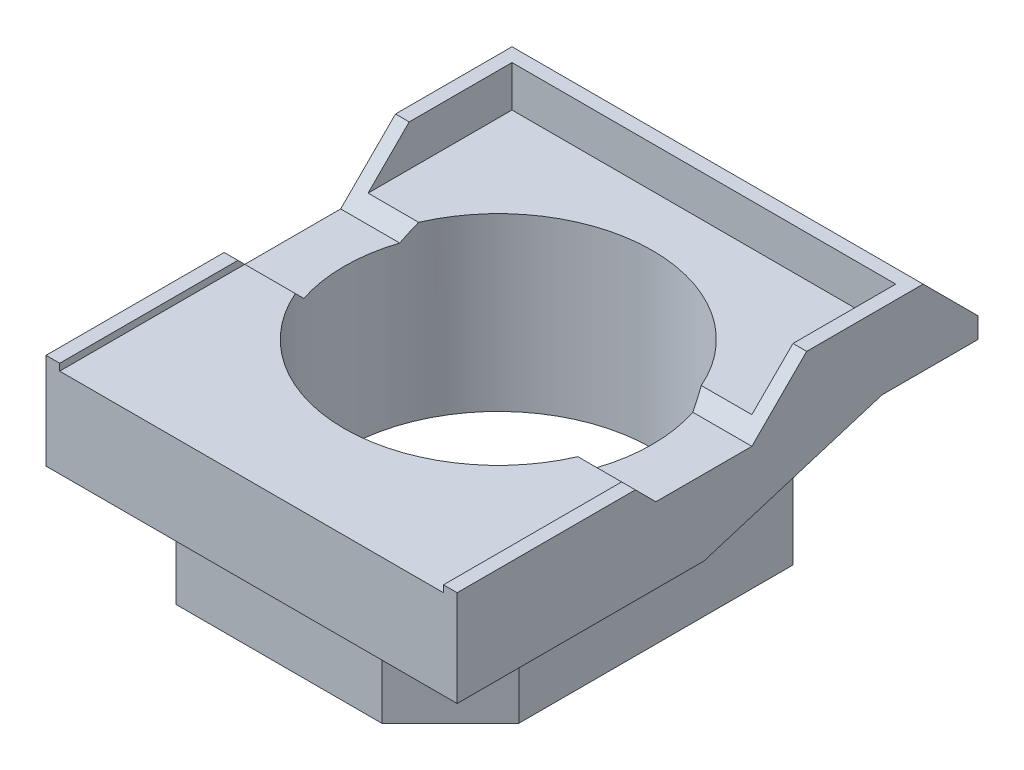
ISO-10303-21;
HEADER;
FILE_DESCRIPTION(('STEP AP214'),'2;1');
FILE_NAME('part.step','',(''),(''),'','','');
FILE_SCHEMA(('AUTOMOTIVE_DESIGN { 1 0 10303 214 1 1 1 1 }'));
ENDSEC;
DATA;
#1=APPLICATION_CONTEXT('core data for automotive mechanical design processes');
#2=APPLICATION_PROTOCOL_DEFINITION('international standard','automotive_design',2000,#1);
#3=PRODUCT_CONTEXT('',#1,'mechanical');
#4=PRODUCT('Part','Part','',(#3));
#5=PRODUCT_RELATED_PRODUCT_CATEGORY('part','',(#4));
#6=PRODUCT_DEFINITION_FORMATION('','',#4);
#7=PRODUCT_DEFINITION_CONTEXT('part definition',#1,'design');
#8=PRODUCT_DEFINITION('design','',#6,#7);
#9=PRODUCT_DEFINITION_SHAPE('','',#8);
#10=(LENGTH_UNIT() NAMED_UNIT(*) SI_UNIT(.MILLI.,.METRE.));
#11=(NAMED_UNIT(*) PLANE_ANGLE_UNIT() SI_UNIT($,.RADIAN.));
#12=(NAMED_UNIT(*) SI_UNIT($,.STERADIAN.) SOLID_ANGLE_UNIT());
#13=UNCERTAINTY_MEASURE_WITH_UNIT(LENGTH_MEASURE(1.E-05),#10,'distance_accuracy_value','');
#14=(GEOMETRIC_REPRESENTATION_CONTEXT(3) GLOBAL_UNCERTAINTY_ASSIGNED_CONTEXT((#13)) GLOBAL_UNIT_ASSIGNED_CONTEXT((#10,
#11,#12)) REPRESENTATION_CONTEXT('',''));
#15=CARTESIAN_POINT('',(0.,0.,0.));
#16=DIRECTION('',(0.,0.,1.));
#17=DIRECTION('',(1.,0.,0.));
#18=AXIS2_PLACEMENT_3D('',#15,#16,#17);
#19=CARTESIAN_POINT('',(15.,9.5,-7.49999999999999));
#20=DIRECTION('',(0.,-0.707106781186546,-0.707106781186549));
#21=DIRECTION('',(0.,0.707106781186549,-0.707106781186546));
#22=AXIS2_PLACEMENT_3D('',#19,#20,#21);
#23=PLANE('',#22);
#24=DIRECTION('',(-1.,0.,0.));
#25=VECTOR('',#24,1.);
#26=CARTESIAN_POINT('',(15.,5.5,-3.5));
#27=LINE('',#26,#25);
#28=CARTESIAN_POINT('',(-10.6917023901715,5.5,-3.5));
#29=VERTEX_POINT('',#28);
#30=CARTESIAN_POINT('',(-15.,5.5,-3.5));
#31=VERTEX_POINT('',#30);
#32=EDGE_CURVE('E267',#29,#31,#27,.T.);
#33=ORIENTED_EDGE('',*,*,#32,.F.);
#34=CARTESIAN_POINT('',(0.,1.99999999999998,0.));
#35=DIRECTION('',(0.,-0.707106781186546,-0.707106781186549));
#36=DIRECTION('',(0.,-0.707106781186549,0.707106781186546));
#37=AXIS2_PLACEMENT_3D('',#34,#35,#36);
#38=ELLIPSE('',#37,15.9099025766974,11.25);
#39=CARTESIAN_POINT('',(-10.3107953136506,6.5,-4.5));
#40=VERTEX_POINT('',#39);
#41=EDGE_CURVE('E251',#29,#40,#38,.T.);
#42=ORIENTED_EDGE('',*,*,#41,.T.);
#43=DIRECTION('',(-1.,0.,0.));
#44=VECTOR('',#43,1.);
#45=CARTESIAN_POINT('',(15.,6.5,-4.5));
#46=LINE('',#45,#44);
#47=CARTESIAN_POINT('',(-14.,6.5,-4.5));
#48=VERTEX_POINT('',#47);
#49=EDGE_CURVE('E264',#40,#48,#46,.T.);
#50=ORIENTED_EDGE('',*,*,#49,.T.);
#51=DIRECTION('',(0.,0.707106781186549,-0.707106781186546));
#52=VECTOR('',#51,1.);
#53=CARTESIAN_POINT('',(-14.,9.5,-7.49999999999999));
#54=LINE('',#53,#52);
#55=CARTESIAN_POINT('',(-14.,9.5,-7.49999999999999));
#56=VERTEX_POINT('',#55);
#57=EDGE_CURVE('E293',#48,#56,#54,.T.);
#58=ORIENTED_EDGE('',*,*,#57,.T.);
#59=DIRECTION('',(-1.,0.,0.));
#60=VECTOR('',#59,1.);
#61=CARTESIAN_POINT('',(15.,9.5,-7.49999999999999));
#62=LINE('',#61,#60);
#63=CARTESIAN_POINT('',(-15.,9.5,-7.49999999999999));
#64=VERTEX_POINT('',#63);
#65=EDGE_CURVE('E435',#56,#64,#62,.T.);
#66=ORIENTED_EDGE('',*,*,#65,.T.);
#67=DIRECTION('',(0.,-0.707106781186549,0.707106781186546));
#68=VECTOR('',#67,1.);
#69=CARTESIAN_POINT('',(-15.,9.5,-7.49999999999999));
#70=LINE('',#69,#68);
#71=EDGE_CURVE('E398',#64,#31,#70,.T.);
#72=ORIENTED_EDGE('',*,*,#71,.T.);
#73=EDGE_LOOP('',(#33,#42,#50,#58,#66,#72));
#74=FACE_BOUND('',#73,.T.);
#75=ADVANCED_FACE('F28',(#74),#23,.F.);
#76=CARTESIAN_POINT('',(15.,5.5,-3.5));
#77=DIRECTION('',(0.,-1.,0.));
#78=DIRECTION('',(0.,0.,-1.));
#79=AXIS2_PLACEMENT_3D('',#76,#77,#78);
#80=PLANE('',#79);
#81=CARTESIAN_POINT('',(15.,5.5,-3.5));
#82=VERTEX_POINT('',#81);
#83=CARTESIAN_POINT('',(10.6917023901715,5.5,-3.5));
#84=VERTEX_POINT('',#83);
#85=EDGE_CURVE('E432',#82,#84,#27,.T.);
#86=ORIENTED_EDGE('',*,*,#85,.T.);
#87=CARTESIAN_POINT('',(0.,5.5,0.));
#88=DIRECTION('',(0.,-1.,0.));
#89=DIRECTION('',(0.,0.,-1.));
#90=AXIS2_PLACEMENT_3D('',#87,#88,#89);
#91=CIRCLE('',#90,11.25);
#92=CARTESIAN_POINT('',(10.6917023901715,5.5,3.5));
#93=VERTEX_POINT('',#92);
#94=EDGE_CURVE('E603',#84,#93,#91,.T.);
#95=ORIENTED_EDGE('',*,*,#94,.T.);
#96=DIRECTION('',(-1.,0.,0.));
#97=VECTOR('',#96,1.);
#98=CARTESIAN_POINT('',(15.,5.5,3.5));
#99=LINE('',#98,#97);
#100=CARTESIAN_POINT('',(15.,5.5,3.5));
#101=VERTEX_POINT('',#100);
#102=EDGE_CURVE('E429',#101,#93,#99,.T.);
#103=ORIENTED_EDGE('',*,*,#102,.F.);
#104=DIRECTION('',(0.,0.,1.));
#105=VECTOR('',#104,1.);
#106=CARTESIAN_POINT('',(15.,5.5,-3.5));
#107=LINE('',#106,#105);
#108=EDGE_CURVE('E420',#82,#101,#107,.T.);
#109=ORIENTED_EDGE('',*,*,#108,.F.);
#110=EDGE_LOOP('',(#86,#95,#103,#109));
#111=FACE_BOUND('',#110,.T.);
#112=ADVANCED_FACE('F565',(#111),#80,.F.);
#113=CARTESIAN_POINT('',(15.,5.5,3.5));
#114=DIRECTION('',(0.,-0.707106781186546,0.707106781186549));
#115=DIRECTION('',(0.,-0.707106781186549,-0.707106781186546));
#116=AXIS2_PLACEMENT_3D('',#113,#114,#115);
#117=PLANE('',#116);
#118=ORIENTED_EDGE('',*,*,#102,.T.);
#119=CARTESIAN_POINT('',(0.,1.99999999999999,0.));
#120=DIRECTION('',(0.,-0.707106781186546,0.707106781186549));
#121=DIRECTION('',(0.,-0.707106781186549,-0.707106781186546));
#122=AXIS2_PLACEMENT_3D('',#119,#120,#121);
#123=ELLIPSE('',#122,15.9099025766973,11.25);
#124=CARTESIAN_POINT('',(10.3107953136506,6.5,4.49999999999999));
#125=VERTEX_POINT('',#124);
#126=EDGE_CURVE('E599',#93,#125,#123,.T.);
#127=ORIENTED_EDGE('',*,*,#126,.T.);
#128=DIRECTION('',(1.,0.,0.));
#129=VECTOR('',#128,1.);
#130=CARTESIAN_POINT('',(15.,6.5,4.49999999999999));
#131=LINE('',#130,#129);
#132=CARTESIAN_POINT('',(14.,6.5,4.49999999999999));
#133=VERTEX_POINT('',#132);
#134=EDGE_CURVE('E449',#125,#133,#131,.T.);
#135=ORIENTED_EDGE('',*,*,#134,.T.);
#136=DIRECTION('',(0.,0.707106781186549,0.707106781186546));
#137=VECTOR('',#136,1.);
#138=CARTESIAN_POINT('',(14.,5.5,3.5));
#139=LINE('',#138,#137);
#140=CARTESIAN_POINT('',(14.,7.,4.99999999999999));
#141=VERTEX_POINT('',#140);
#142=EDGE_CURVE('E453',#133,#141,#139,.T.);
#143=ORIENTED_EDGE('',*,*,#142,.T.);
#144=DIRECTION('',(-1.,0.,0.));
#145=VECTOR('',#144,1.);
#146=CARTESIAN_POINT('',(15.,7.,4.99999999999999));
#147=LINE('',#146,#145);
#148=CARTESIAN_POINT('',(15.,7.,4.99999999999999));
#149=VERTEX_POINT('',#148);
#150=EDGE_CURVE('E425',#149,#141,#147,.T.);
#151=ORIENTED_EDGE('',*,*,#150,.F.);
#152=DIRECTION('',(0.,0.707106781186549,0.707106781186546));
#153=VECTOR('',#152,1.);
#154=CARTESIAN_POINT('',(15.,5.5,3.5));
#155=LINE('',#154,#153);
#156=EDGE_CURVE('E422',#101,#149,#155,.T.);
#157=ORIENTED_EDGE('',*,*,#156,.F.);
#158=EDGE_LOOP('',(#118,#127,#135,#143,#151,#157));
#159=FACE_BOUND('',#158,.T.);
#160=ADVANCED_FACE('F569',(#159),#117,.F.);
#161=CARTESIAN_POINT('',(15.,7.,4.99999999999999));
#162=DIRECTION('',(0.,-1.,0.));
#163=DIRECTION('',(0.,0.,-1.));
#164=AXIS2_PLACEMENT_3D('',#161,#162,#163);
#165=PLANE('',#164);
#166=DIRECTION('',(-1.,0.,0.));
#167=VECTOR('',#166,1.);
#168=CARTESIAN_POINT('',(15.,7.,18.));
#169=LINE('',#168,#167);
#170=CARTESIAN_POINT('',(-14.,7.,18.));
#171=VERTEX_POINT('',#170);
#172=CARTESIAN_POINT('',(-15.,7.,18.));
#173=VERTEX_POINT('',#172);
#174=EDGE_CURVE('E445',#171,#173,#169,.T.);
#175=ORIENTED_EDGE('',*,*,#174,.F.);
#176=DIRECTION('',(0.,0.,-1.));
#177=VECTOR('',#176,1.);
#178=CARTESIAN_POINT('',(-14.,7.,5.));
#179=LINE('',#178,#177);
#180=CARTESIAN_POINT('',(-14.,7.,4.99999999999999));
#181=VERTEX_POINT('',#180);
#182=EDGE_CURVE('E290',#171,#181,#179,.T.);
#183=ORIENTED_EDGE('',*,*,#182,.T.);
#184=CARTESIAN_POINT('',(-15.,7.,4.99999999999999));
#185=VERTEX_POINT('',#184);
#186=EDGE_CURVE('E424',#181,#185,#147,.T.);
#187=ORIENTED_EDGE('',*,*,#186,.T.);
#188=DIRECTION('',(0.,0.,1.));
#189=VECTOR('',#188,1.);
#190=CARTESIAN_POINT('',(-15.,7.,4.99999999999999));
#191=LINE('',#190,#189);
#192=EDGE_CURVE('E385',#185,#173,#191,.T.);
#193=ORIENTED_EDGE('',*,*,#192,.T.);
#194=EDGE_LOOP('',(#175,#183,#187,#193));
#195=FACE_BOUND('',#194,.T.);
#196=ADVANCED_FACE('F639',(#195),#165,.F.);
#197=CARTESIAN_POINT('',(15.,2.00000000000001,-20.));
#198=DIRECTION('',(0.,0.,1.));
#199=DIRECTION('',(1.,0.,0.));
#200=AXIS2_PLACEMENT_3D('',#197,#198,#199);
#201=PLANE('',#200);
#202=DIRECTION('',(1.,0.,0.));
#203=VECTOR('',#202,1.);
#204=CARTESIAN_POINT('',(12.5,4.,-20.));
#205=LINE('',#204,#203);
#206=CARTESIAN_POINT('',(-15.,4.,-20.));
#207=VERTEX_POINT('',#206);
#208=CARTESIAN_POINT('',(15.,4.,-20.));
#209=VERTEX_POINT('',#208);
#210=EDGE_CURVE('E338',#207,#209,#205,.T.);
#211=ORIENTED_EDGE('',*,*,#210,.F.);
#212=DIRECTION('',(0.,1.,0.));
#213=VECTOR('',#212,1.);
#214=CARTESIAN_POINT('',(-15.,2.00000000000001,-20.));
#215=LINE('',#214,#213);
#216=CARTESIAN_POINT('',(-15.,5.50000000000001,-20.));
#217=VERTEX_POINT('',#216);
#218=EDGE_CURVE('E391',#207,#217,#215,.T.);
#219=ORIENTED_EDGE('',*,*,#218,.T.);
#220=DIRECTION('',(-1.,0.,0.));
#221=VECTOR('',#220,1.);
#222=CARTESIAN_POINT('',(15.,5.50000000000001,-20.));
#223=LINE('',#222,#221);
#224=CARTESIAN_POINT('',(15.,5.50000000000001,-20.));
#225=VERTEX_POINT('',#224);
#226=EDGE_CURVE('E442',#225,#217,#223,.T.);
#227=ORIENTED_EDGE('',*,*,#226,.F.);
#228=DIRECTION('',(0.,1.,0.));
#229=VECTOR('',#228,1.);
#230=CARTESIAN_POINT('',(15.,2.00000000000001,-20.));
#231=LINE('',#230,#229);
#232=EDGE_CURVE('E412',#209,#225,#231,.T.);
#233=ORIENTED_EDGE('',*,*,#232,.F.);
#234=EDGE_LOOP('',(#211,#219,#227,#233));
#235=FACE_BOUND('',#234,.T.);
#236=ADVANCED_FACE('F543',(#235),#201,.F.);
#237=CARTESIAN_POINT('',(-15.,7.,18.));
#238=DIRECTION('',(1.,0.,0.));
#239=DIRECTION('',(0.,0.,-1.));
#240=AXIS2_PLACEMENT_3D('',#237,#238,#239);
#241=PLANE('',#240);
#242=DIRECTION('',(0.,0.,1.));
#243=VECTOR('',#242,1.);
#244=CARTESIAN_POINT('',(-15.,4.,-13.));
#245=LINE('',#244,#243);
#246=CARTESIAN_POINT('',(-15.,4.,-13.));
#247=VERTEX_POINT('',#246);
#248=EDGE_CURVE('E318',#207,#247,#245,.T.);
#249=ORIENTED_EDGE('',*,*,#248,.T.);
#250=DIRECTION('',(0.,-0.294085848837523,0.95577900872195));
#251=VECTOR('',#250,1.);
#252=CARTESIAN_POINT('',(-15.,0.,0.));
#253=LINE('',#252,#251);
#254=CARTESIAN_POINT('',(-15.,0.,0.));
#255=VERTEX_POINT('',#254);
#256=EDGE_CURVE('E315',#247,#255,#253,.T.);
#257=ORIENTED_EDGE('',*,*,#256,.T.);
#258=DIRECTION('',(0.,0.,-1.));
#259=VECTOR('',#258,1.);
#260=CARTESIAN_POINT('',(-15.,0.,18.));
#261=LINE('',#260,#259);
#262=CARTESIAN_POINT('',(-15.,0.,18.));
#263=VERTEX_POINT('',#262);
#264=EDGE_CURVE('E382',#263,#255,#261,.T.);
#265=ORIENTED_EDGE('',*,*,#264,.F.);
#266=DIRECTION('',(0.,-1.,0.));
#267=VECTOR('',#266,1.);
#268=CARTESIAN_POINT('',(-15.,7.,18.));
#269=LINE('',#268,#267);
#270=EDGE_CURVE('E388',#173,#263,#269,.T.);
#271=ORIENTED_EDGE('',*,*,#270,.F.);
#272=ORIENTED_EDGE('',*,*,#192,.F.);
#273=DIRECTION('',(0.,0.707106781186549,0.707106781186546));
#274=VECTOR('',#273,1.);
#275=CARTESIAN_POINT('',(-15.,5.5,3.5));
#276=LINE('',#275,#274);
#277=CARTESIAN_POINT('',(-15.,5.5,3.5));
#278=VERTEX_POINT('',#277);
#279=EDGE_CURVE('E403',#278,#185,#276,.T.);
#280=ORIENTED_EDGE('',*,*,#279,.F.);
#281=DIRECTION('',(0.,0.,1.));
#282=VECTOR('',#281,1.);
#283=CARTESIAN_POINT('',(-15.,5.5,-3.5));
#284=LINE('',#283,#282);
#285=EDGE_CURVE('E400',#31,#278,#284,.T.);
#286=ORIENTED_EDGE('',*,*,#285,.F.);
#287=ORIENTED_EDGE('',*,*,#71,.F.);
#288=DIRECTION('',(0.,0.,1.));
#289=VECTOR('',#288,1.);
#290=CARTESIAN_POINT('',(-15.,9.5,-16.));
#291=LINE('',#290,#289);
#292=CARTESIAN_POINT('',(-15.,9.5,-16.));
#293=VERTEX_POINT('',#292);
#294=EDGE_CURVE('E395',#293,#64,#291,.T.);
#295=ORIENTED_EDGE('',*,*,#294,.F.);
#296=DIRECTION('',(0.,0.707106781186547,0.707106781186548));
#297=VECTOR('',#296,1.);
#298=CARTESIAN_POINT('',(-15.,5.50000000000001,-20.));
#299=LINE('',#298,#297);
#300=EDGE_CURVE('E393',#217,#293,#299,.T.);
#301=ORIENTED_EDGE('',*,*,#300,.F.);
#302=ORIENTED_EDGE('',*,*,#218,.F.);
#303=EDGE_LOOP('',(#249,#257,#265,#271,#272,#280,#286,#287,#295,#301,#302));
#304=FACE_BOUND('',#303,.T.);
#305=ADVANCED_FACE('F528',(#304),#241,.F.);
#306=CARTESIAN_POINT('',(15.,0.,18.));
#307=DIRECTION('',(0.,1.,0.));
#308=DIRECTION('',(0.,0.,1.));
#309=AXIS2_PLACEMENT_3D('',#306,#307,#308);
#310=PLANE('',#309);
#311=DIRECTION('',(-1.,0.,0.));
#312=VECTOR('',#311,1.);
#313=CARTESIAN_POINT('',(-12.5,0.,0.));
#314=LINE('',#313,#312);
#315=CARTESIAN_POINT('',(-12.5,0.,0.));
#316=VERTEX_POINT('',#315);
#317=EDGE_CURVE('E325',#316,#255,#314,.T.);
#318=ORIENTED_EDGE('',*,*,#317,.F.);
#319=DIRECTION('',(0.,0.,-1.));
#320=VECTOR('',#319,1.);
#321=CARTESIAN_POINT('',(-12.5,0.,16.));
#322=LINE('',#321,#320);
#323=CARTESIAN_POINT('',(-12.5,0.,11.));
#324=VERTEX_POINT('',#323);
#325=EDGE_CURVE('E366',#324,#316,#322,.T.);
#326=ORIENTED_EDGE('',*,*,#325,.F.);
#327=DIRECTION('',(-0.707106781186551,0.,-0.707106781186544));
#328=VECTOR('',#327,1.);
#329=CARTESIAN_POINT('',(4.75000000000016,0.,28.2499999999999));
#330=LINE('',#329,#328);
#331=CARTESIAN_POINT('',(-7.49999999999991,0.,16.));
#332=VERTEX_POINT('',#331);
#333=EDGE_CURVE('E11',#324,#332,#330,.F.);
#334=ORIENTED_EDGE('',*,*,#333,.T.);
#335=DIRECTION('',(-1.,0.,0.));
#336=VECTOR('',#335,1.);
#337=CARTESIAN_POINT('',(12.5,0.,16.));
#338=LINE('',#337,#336);
#339=CARTESIAN_POINT('',(7.49999999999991,0.,16.));
#340=VERTEX_POINT('',#339);
#341=EDGE_CURVE('E364',#340,#332,#338,.T.);
#342=ORIENTED_EDGE('',*,*,#341,.F.);
#343=DIRECTION('',(-0.707106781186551,0.,0.707106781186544));
#344=VECTOR('',#343,1.);
#345=CARTESIAN_POINT('',(10.25,0.,13.2499999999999));
#346=LINE('',#345,#344);
#347=CARTESIAN_POINT('',(12.5,0.,11.));
#348=VERTEX_POINT('',#347);
#349=EDGE_CURVE('E36',#340,#348,#346,.F.);
#350=ORIENTED_EDGE('',*,*,#349,.T.);
#351=DIRECTION('',(0.,0.,1.));
#352=VECTOR('',#351,1.);
#353=CARTESIAN_POINT('',(12.5,0.,-9.));
#354=LINE('',#353,#352);
#355=CARTESIAN_POINT('',(12.5,0.,0.));
#356=VERTEX_POINT('',#355);
#357=EDGE_CURVE('E361',#356,#348,#354,.T.);
#358=ORIENTED_EDGE('',*,*,#357,.F.);
#359=DIRECTION('',(1.,0.,0.));
#360=VECTOR('',#359,1.);
#361=CARTESIAN_POINT('',(12.5,0.,0.));
#362=LINE('',#361,#360);
#363=CARTESIAN_POINT('',(15.,0.,0.));
#364=VERTEX_POINT('',#363);
#365=EDGE_CURVE('E339',#356,#364,#362,.T.);
#366=ORIENTED_EDGE('',*,*,#365,.T.);
#367=DIRECTION('',(0.,0.,1.));
#368=VECTOR('',#367,1.);
#369=CARTESIAN_POINT('',(15.,0.,18.));
#370=LINE('',#369,#368);
#371=CARTESIAN_POINT('',(15.,0.,18.));
#372=VERTEX_POINT('',#371);
#373=EDGE_CURVE('E372',#364,#372,#370,.T.);
#374=ORIENTED_EDGE('',*,*,#373,.T.);
#375=DIRECTION('',(-1.,0.,0.));
#376=VECTOR('',#375,1.);
#377=CARTESIAN_POINT('',(15.,0.,18.));
#378=LINE('',#377,#376);
#379=EDGE_CURVE('E380',#372,#263,#378,.T.);
#380=ORIENTED_EDGE('',*,*,#379,.T.);
#381=ORIENTED_EDGE('',*,*,#264,.T.);
#382=EDGE_LOOP('',(#318,#326,#334,#342,#350,#358,#366,#374,#380,#381));
#383=FACE_BOUND('',#382,.T.);
#384=ADVANCED_FACE('F472',(#383),#310,.F.);
#385=ORIENTED_EDGE('',*,*,#150,.T.);
#386=DIRECTION('',(0.,0.,1.));
#387=VECTOR('',#386,1.);
#388=CARTESIAN_POINT('',(14.,7.,4.99999999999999));
#389=LINE('',#388,#387);
#390=CARTESIAN_POINT('',(14.,7.,18.));
#391=VERTEX_POINT('',#390);
#392=EDGE_CURVE('E278',#141,#391,#389,.T.);
#393=ORIENTED_EDGE('',*,*,#392,.T.);
#394=CARTESIAN_POINT('',(15.,7.,18.));
#395=VERTEX_POINT('',#394);
#396=EDGE_CURVE('E446',#395,#391,#169,.T.);
#397=ORIENTED_EDGE('',*,*,#396,.F.);
#398=DIRECTION('',(0.,0.,1.));
#399=VECTOR('',#398,1.);
#400=CARTESIAN_POINT('',(15.,7.,4.99999999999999));
#401=LINE('',#400,#399);
#402=EDGE_CURVE('E406',#149,#395,#401,.T.);
#403=ORIENTED_EDGE('',*,*,#402,.F.);
#404=EDGE_LOOP('',(#385,#393,#397,#403));
#405=FACE_BOUND('',#404,.T.);
#406=ADVANCED_FACE('F30',(#405),#165,.F.);
#407=CARTESIAN_POINT('',(15.,7.,18.));
#408=DIRECTION('',(0.,0.,-1.));
#409=DIRECTION('',(-1.,0.,0.));
#410=AXIS2_PLACEMENT_3D('',#407,#408,#409);
#411=PLANE('',#410);
#412=DIRECTION('',(1.,0.,0.));
#413=VECTOR('',#412,1.);
#414=CARTESIAN_POINT('',(-14.,6.5,18.));
#415=LINE('',#414,#413);
#416=CARTESIAN_POINT('',(-14.,6.5,18.));
#417=VERTEX_POINT('',#416);
#418=CARTESIAN_POINT('',(14.,6.5,18.));
#419=VERTEX_POINT('',#418);
#420=EDGE_CURVE('E586',#417,#419,#415,.T.);
#421=ORIENTED_EDGE('',*,*,#420,.F.);
#422=DIRECTION('',(0.,1.,0.));
#423=VECTOR('',#422,1.);
#424=CARTESIAN_POINT('',(-14.,6.5,18.));
#425=LINE('',#424,#423);
#426=EDGE_CURVE('E283',#417,#171,#425,.T.);
#427=ORIENTED_EDGE('',*,*,#426,.T.);
#428=ORIENTED_EDGE('',*,*,#174,.T.);
#429=ORIENTED_EDGE('',*,*,#270,.T.);
#430=ORIENTED_EDGE('',*,*,#379,.F.);
#431=DIRECTION('',(0.,-1.,0.));
#432=VECTOR('',#431,1.);
#433=CARTESIAN_POINT('',(15.,7.,18.));
#434=LINE('',#433,#432);
#435=EDGE_CURVE('E409',#395,#372,#434,.T.);
#436=ORIENTED_EDGE('',*,*,#435,.F.);
#437=ORIENTED_EDGE('',*,*,#396,.T.);
#438=DIRECTION('',(0.,1.,0.));
#439=VECTOR('',#438,1.);
#440=CARTESIAN_POINT('',(14.,6.5,18.));
#441=LINE('',#440,#439);
#442=EDGE_CURVE('E574',#419,#391,#441,.T.);
#443=ORIENTED_EDGE('',*,*,#442,.F.);
#444=EDGE_LOOP('',(#421,#427,#428,#429,#430,#436,#437,#443));
#445=FACE_BOUND('',#444,.T.);
#446=ADVANCED_FACE('F523',(#445),#411,.F.);
#447=CARTESIAN_POINT('',(15.,5.50000000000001,-20.));
#448=DIRECTION('',(0.,-0.707106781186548,0.707106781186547));
#449=DIRECTION('',(0.,-0.707106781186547,-0.707106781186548));
#450=AXIS2_PLACEMENT_3D('',#447,#448,#449);
#451=PLANE('',#450);
#452=ORIENTED_EDGE('',*,*,#300,.T.);
#453=DIRECTION('',(-1.,0.,0.));
#454=VECTOR('',#453,1.);
#455=CARTESIAN_POINT('',(15.,9.5,-16.));
#456=LINE('',#455,#454);
#457=CARTESIAN_POINT('',(15.,9.5,-16.));
#458=VERTEX_POINT('',#457);
#459=EDGE_CURVE('E439',#458,#293,#456,.T.);
#460=ORIENTED_EDGE('',*,*,#459,.F.);
#461=DIRECTION('',(0.,0.707106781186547,0.707106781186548));
#462=VECTOR('',#461,1.);
#463=CARTESIAN_POINT('',(15.,5.50000000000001,-20.));
#464=LINE('',#463,#462);
#465=EDGE_CURVE('E414',#225,#458,#464,.T.);
#466=ORIENTED_EDGE('',*,*,#465,.F.);
#467=ORIENTED_EDGE('',*,*,#226,.T.);
#468=EDGE_LOOP('',(#452,#460,#466,#467));
#469=FACE_BOUND('',#468,.T.);
#470=ADVANCED_FACE('F548',(#469),#451,.F.);
#471=CARTESIAN_POINT('',(15.,9.5,-16.));
#472=DIRECTION('',(0.,-1.,0.));
#473=DIRECTION('',(0.,0.,-1.));
#474=AXIS2_PLACEMENT_3D('',#471,#472,#473);
#475=PLANE('',#474);
#476=ORIENTED_EDGE('',*,*,#65,.F.);
#477=DIRECTION('',(0.,0.,1.));
#478=VECTOR('',#477,1.);
#479=CARTESIAN_POINT('',(-14.,9.5,18.));
#480=LINE('',#479,#478);
#481=CARTESIAN_POINT('',(-14.,9.5,-15.));
#482=VERTEX_POINT('',#481);
#483=EDGE_CURVE('E594',#482,#56,#480,.T.);
#484=ORIENTED_EDGE('',*,*,#483,.F.);
#485=DIRECTION('',(-1.,0.,0.));
#486=VECTOR('',#485,1.);
#487=CARTESIAN_POINT('',(-14.,9.5,-15.));
#488=LINE('',#487,#486);
#489=CARTESIAN_POINT('',(14.,9.5,-15.));
#490=VERTEX_POINT('',#489);
#491=EDGE_CURVE('E590',#490,#482,#488,.T.);
#492=ORIENTED_EDGE('',*,*,#491,.F.);
#493=DIRECTION('',(0.,0.,-1.));
#494=VECTOR('',#493,1.);
#495=CARTESIAN_POINT('',(14.,9.5,18.));
#496=LINE('',#495,#494);
#497=CARTESIAN_POINT('',(14.,9.5,-7.49999999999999));
#498=VERTEX_POINT('',#497);
#499=EDGE_CURVE('E558',#498,#490,#496,.T.);
#500=ORIENTED_EDGE('',*,*,#499,.F.);
#501=CARTESIAN_POINT('',(15.,9.5,-7.49999999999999));
#502=VERTEX_POINT('',#501);
#503=EDGE_CURVE('E436',#502,#498,#62,.T.);
#504=ORIENTED_EDGE('',*,*,#503,.F.);
#505=DIRECTION('',(0.,0.,1.));
#506=VECTOR('',#505,1.);
#507=CARTESIAN_POINT('',(15.,9.5,-16.));
#508=LINE('',#507,#506);
#509=EDGE_CURVE('E416',#458,#502,#508,.T.);
#510=ORIENTED_EDGE('',*,*,#509,.F.);
#511=ORIENTED_EDGE('',*,*,#459,.T.);
#512=ORIENTED_EDGE('',*,*,#294,.T.);
#513=EDGE_LOOP('',(#476,#484,#492,#500,#504,#510,#511,#512));
#514=FACE_BOUND('',#513,.T.);
#515=ADVANCED_FACE('F556',(#514),#475,.F.);
#516=CARTESIAN_POINT('',(14.,6.5,-4.5));
#517=VERTEX_POINT('',#516);
#518=CARTESIAN_POINT('',(10.3107953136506,6.5,-4.5));
#519=VERTEX_POINT('',#518);
#520=EDGE_CURVE('E275',#517,#519,#46,.T.);
#521=ORIENTED_EDGE('',*,*,#520,.T.);
#522=EDGE_CURVE('E254',#519,#84,#38,.T.);
#523=ORIENTED_EDGE('',*,*,#522,.T.);
#524=ORIENTED_EDGE('',*,*,#85,.F.);
#525=DIRECTION('',(0.,-0.707106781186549,0.707106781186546));
#526=VECTOR('',#525,1.);
#527=CARTESIAN_POINT('',(15.,9.5,-7.49999999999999));
#528=LINE('',#527,#526);
#529=EDGE_CURVE('E418',#502,#82,#528,.T.);
#530=ORIENTED_EDGE('',*,*,#529,.F.);
#531=ORIENTED_EDGE('',*,*,#503,.T.);
#532=DIRECTION('',(0.,-0.707106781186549,0.707106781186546));
#533=VECTOR('',#532,1.);
#534=CARTESIAN_POINT('',(14.,9.5,-7.49999999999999));
#535=LINE('',#534,#533);
#536=EDGE_CURVE('E287',#498,#517,#535,.T.);
#537=ORIENTED_EDGE('',*,*,#536,.T.);
#538=EDGE_LOOP('',(#521,#523,#524,#530,#531,#537));
#539=FACE_BOUND('',#538,.T.);
#540=ADVANCED_FACE('F560',(#539),#23,.F.);
#541=CARTESIAN_POINT('',(-10.6917023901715,5.5,3.5));
#542=VERTEX_POINT('',#541);
#543=EDGE_CURVE('E428',#542,#278,#99,.T.);
#544=ORIENTED_EDGE('',*,*,#543,.F.);
#545=EDGE_CURVE('E268',#542,#29,#91,.T.);
#546=ORIENTED_EDGE('',*,*,#545,.T.);
#547=ORIENTED_EDGE('',*,*,#32,.T.);
#548=ORIENTED_EDGE('',*,*,#285,.T.);
#549=EDGE_LOOP('',(#544,#546,#547,#548));
#550=FACE_BOUND('',#549,.T.);
#551=ADVANCED_FACE('F625',(#550),#80,.F.);
#552=CARTESIAN_POINT('',(-14.,6.5,4.49999999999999));
#553=VERTEX_POINT('',#552);
#554=CARTESIAN_POINT('',(-10.3107953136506,6.5,4.49999999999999));
#555=VERTEX_POINT('',#554);
#556=EDGE_CURVE('E450',#553,#555,#131,.T.);
#557=ORIENTED_EDGE('',*,*,#556,.T.);
#558=EDGE_CURVE('E600',#555,#542,#123,.T.);
#559=ORIENTED_EDGE('',*,*,#558,.T.);
#560=ORIENTED_EDGE('',*,*,#543,.T.);
#561=ORIENTED_EDGE('',*,*,#279,.T.);
#562=ORIENTED_EDGE('',*,*,#186,.F.);
#563=DIRECTION('',(0.,-0.707106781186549,-0.707106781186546));
#564=VECTOR('',#563,1.);
#565=CARTESIAN_POINT('',(-14.,5.5,3.5));
#566=LINE('',#565,#564);
#567=EDGE_CURVE('E259',#181,#553,#566,.T.);
#568=ORIENTED_EDGE('',*,*,#567,.T.);
#569=EDGE_LOOP('',(#557,#559,#560,#561,#562,#568));
#570=FACE_BOUND('',#569,.T.);
#571=ADVANCED_FACE('F632',(#570),#117,.F.);
#572=CARTESIAN_POINT('',(15.,7.,18.));
#573=DIRECTION('',(1.,0.,0.));
#574=DIRECTION('',(0.,0.,-1.));
#575=AXIS2_PLACEMENT_3D('',#572,#573,#574);
#576=PLANE('',#575);
#577=DIRECTION('',(0.,-0.294085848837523,0.95577900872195));
#578=VECTOR('',#577,1.);
#579=CARTESIAN_POINT('',(15.,0.,0.));
#580=LINE('',#579,#578);
#581=CARTESIAN_POINT('',(15.,4.,-13.));
#582=VERTEX_POINT('',#581);
#583=EDGE_CURVE('E332',#582,#364,#580,.T.);
#584=ORIENTED_EDGE('',*,*,#583,.F.);
#585=DIRECTION('',(0.,0.,1.));
#586=VECTOR('',#585,1.);
#587=CARTESIAN_POINT('',(15.,4.,-13.));
#588=LINE('',#587,#586);
#589=EDGE_CURVE('E328',#209,#582,#588,.T.);
#590=ORIENTED_EDGE('',*,*,#589,.F.);
#591=ORIENTED_EDGE('',*,*,#232,.T.);
#592=ORIENTED_EDGE('',*,*,#465,.T.);
#593=ORIENTED_EDGE('',*,*,#509,.T.);
#594=ORIENTED_EDGE('',*,*,#529,.T.);
#595=ORIENTED_EDGE('',*,*,#108,.T.);
#596=ORIENTED_EDGE('',*,*,#156,.T.);
#597=ORIENTED_EDGE('',*,*,#402,.T.);
#598=ORIENTED_EDGE('',*,*,#435,.T.);
#599=ORIENTED_EDGE('',*,*,#373,.F.);
#600=EDGE_LOOP('',(#584,#590,#591,#592,#593,#594,#595,#596,#597,#598,#599));
#601=FACE_BOUND('',#600,.T.);
#602=ADVANCED_FACE('F517',(#601),#576,.T.);
#603=CARTESIAN_POINT('',(0.,0.,0.));
#604=DIRECTION('',(0.,-1.,0.));
#605=DIRECTION('',(0.,0.,-1.));
#606=AXIS2_PLACEMENT_3D('',#603,#604,#605);
#607=CYLINDRICAL_SURFACE('',#606,12.);
#608=DIRECTION('',(0.,-1.,0.));
#609=VECTOR('',#608,1.);
#610=CARTESIAN_POINT('',(-7.93725393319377,0.,-9.00000000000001));
#611=LINE('',#610,#609);
#612=CARTESIAN_POINT('',(-7.93725393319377,4.,-9.));
#613=VERTEX_POINT('',#612);
#614=CARTESIAN_POINT('',(-7.93725393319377,-6.,-9.00000000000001));
#615=VERTEX_POINT('',#614);
#616=EDGE_CURVE('E373',#613,#615,#611,.T.);
#617=ORIENTED_EDGE('',*,*,#616,.F.);
#618=CARTESIAN_POINT('',(0.,4.,0.));
#619=DIRECTION('',(0.,1.,0.));
#620=DIRECTION('',(0.,0.,1.));
#621=AXIS2_PLACEMENT_3D('',#618,#619,#620);
#622=CIRCLE('',#621,12.);
#623=CARTESIAN_POINT('',(7.93725393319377,4.,-9.));
#624=VERTEX_POINT('',#623);
#625=EDGE_CURVE('E298',#624,#613,#622,.T.);
#626=ORIENTED_EDGE('',*,*,#625,.F.);
#627=DIRECTION('',(0.,-1.,0.));
#628=VECTOR('',#627,1.);
#629=CARTESIAN_POINT('',(7.93725393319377,0.,-9.));
#630=LINE('',#629,#628);
#631=CARTESIAN_POINT('',(7.93725393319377,-6.,-9.));
#632=VERTEX_POINT('',#631);
#633=EDGE_CURVE('E369',#624,#632,#630,.T.);
#634=ORIENTED_EDGE('',*,*,#633,.T.);
#635=CARTESIAN_POINT('',(0.,-6.,0.));
#636=DIRECTION('',(0.,-1.,0.));
#637=DIRECTION('',(0.,0.,1.));
#638=AXIS2_PLACEMENT_3D('',#635,#636,#637);
#639=CIRCLE('',#638,12.);
#640=EDGE_CURVE('E359',#615,#632,#639,.T.);
#641=ORIENTED_EDGE('',*,*,#640,.F.);
#642=EDGE_LOOP('',(#617,#626,#634,#641));
#643=FACE_BOUND('',#642,.T.);
#644=ADVANCED_FACE('F502',(#643),#607,.T.);
#645=CARTESIAN_POINT('',(12.5,0.,-9.));
#646=DIRECTION('',(0.,0.,-1.));
#647=DIRECTION('',(-1.,0.,0.));
#648=AXIS2_PLACEMENT_3D('',#645,#646,#647);
#649=PLANE('',#648);
#650=DIRECTION('',(1.,0.,0.));
#651=VECTOR('',#650,1.);
#652=CARTESIAN_POINT('',(12.5,-6.,-9.));
#653=LINE('',#652,#651);
#654=CARTESIAN_POINT('',(12.5,-6.,-9.));
#655=VERTEX_POINT('',#654);
#656=EDGE_CURVE('E342',#632,#655,#653,.T.);
#657=ORIENTED_EDGE('',*,*,#656,.F.);
#658=ORIENTED_EDGE('',*,*,#633,.F.);
#659=DIRECTION('',(-1.,0.,0.));
#660=VECTOR('',#659,1.);
#661=CARTESIAN_POINT('',(7.93725393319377,4.,-9.));
#662=LINE('',#661,#660);
#663=CARTESIAN_POINT('',(12.5,4.,-9.));
#664=VERTEX_POINT('',#663);
#665=EDGE_CURVE('E295',#664,#624,#662,.T.);
#666=ORIENTED_EDGE('',*,*,#665,.F.);
#667=DIRECTION('',(0.,-1.,0.));
#668=VECTOR('',#667,1.);
#669=CARTESIAN_POINT('',(12.5,31.3130005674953,-9.));
#670=LINE('',#669,#668);
#671=CARTESIAN_POINT('',(12.5,2.76923076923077,-9.00000000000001));
#672=VERTEX_POINT('',#671);
#673=EDGE_CURVE('E301',#664,#672,#670,.T.);
#674=ORIENTED_EDGE('',*,*,#673,.T.);
#675=DIRECTION('',(0.,-1.,0.));
#676=VECTOR('',#675,1.);
#677=CARTESIAN_POINT('',(12.5,0.,-9.));
#678=LINE('',#677,#676);
#679=EDGE_CURVE('E368',#672,#655,#678,.T.);
#680=ORIENTED_EDGE('',*,*,#679,.T.);
#681=EDGE_LOOP('',(#657,#658,#666,#674,#680));
#682=FACE_BOUND('',#681,.T.);
#683=ADVANCED_FACE('F505',(#682),#649,.T.);
#684=CARTESIAN_POINT('',(-12.5,0.,-9.00000000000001));
#685=DIRECTION('',(0.,0.,-1.));
#686=DIRECTION('',(0.,1.,0.));
#687=AXIS2_PLACEMENT_3D('',#684,#685,#686);
#688=PLANE('',#687);
#689=DIRECTION('',(1.,0.,0.));
#690=VECTOR('',#689,1.);
#691=CARTESIAN_POINT('',(-12.5,-6.,-9.00000000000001));
#692=LINE('',#691,#690);
#693=CARTESIAN_POINT('',(-12.5,-6.,-9.00000000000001));
#694=VERTEX_POINT('',#693);
#695=EDGE_CURVE('E356',#694,#615,#692,.T.);
#696=ORIENTED_EDGE('',*,*,#695,.F.);
#697=DIRECTION('',(0.,-1.,0.));
#698=VECTOR('',#697,1.);
#699=CARTESIAN_POINT('',(-12.5,0.,-9.00000000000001));
#700=LINE('',#699,#698);
#701=CARTESIAN_POINT('',(-12.5,2.76923076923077,-9.00000000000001));
#702=VERTEX_POINT('',#701);
#703=EDGE_CURVE('E375',#702,#694,#700,.T.);
#704=ORIENTED_EDGE('',*,*,#703,.F.);
#705=DIRECTION('',(0.,-1.,0.));
#706=VECTOR('',#705,1.);
#707=CARTESIAN_POINT('',(-12.5,31.3130005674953,-9.));
#708=LINE('',#707,#706);
#709=CARTESIAN_POINT('',(-12.5,4.,-9.));
#710=VERTEX_POINT('',#709);
#711=EDGE_CURVE('E305',#710,#702,#708,.T.);
#712=ORIENTED_EDGE('',*,*,#711,.F.);
#713=DIRECTION('',(-1.,0.,0.));
#714=VECTOR('',#713,1.);
#715=CARTESIAN_POINT('',(-12.5,4.,-9.));
#716=LINE('',#715,#714);
#717=EDGE_CURVE('E306',#613,#710,#716,.T.);
#718=ORIENTED_EDGE('',*,*,#717,.F.);
#719=ORIENTED_EDGE('',*,*,#616,.T.);
#720=EDGE_LOOP('',(#696,#704,#712,#718,#719));
#721=FACE_BOUND('',#720,.T.);
#722=ADVANCED_FACE('F496',(#721),#688,.T.);
#723=CARTESIAN_POINT('',(-12.5,0.,16.));
#724=DIRECTION('',(-1.,0.,0.));
#725=DIRECTION('',(0.,0.,1.));
#726=AXIS2_PLACEMENT_3D('',#723,#724,#725);
#727=PLANE('',#726);
#728=DIRECTION('',(0.,0.,-1.));
#729=VECTOR('',#728,1.);
#730=CARTESIAN_POINT('',(-12.5,-6.,16.));
#731=LINE('',#730,#729);
#732=CARTESIAN_POINT('',(-12.5,-6.,11.));
#733=VERTEX_POINT('',#732);
#734=EDGE_CURVE('E354',#733,#694,#731,.T.);
#735=ORIENTED_EDGE('',*,*,#734,.F.);
#736=DIRECTION('',(0.,1.,0.));
#737=VECTOR('',#736,1.);
#738=CARTESIAN_POINT('',(-12.5,0.,11.));
#739=LINE('',#738,#737);
#740=EDGE_CURVE('E43',#733,#324,#739,.T.);
#741=ORIENTED_EDGE('',*,*,#740,.T.);
#742=ORIENTED_EDGE('',*,*,#325,.T.);
#743=DIRECTION('',(0.,-0.294085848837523,0.95577900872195));
#744=VECTOR('',#743,1.);
#745=CARTESIAN_POINT('',(-12.5,0.,0.));
#746=LINE('',#745,#744);
#747=EDGE_CURVE('E321',#702,#316,#746,.T.);
#748=ORIENTED_EDGE('',*,*,#747,.F.);
#749=ORIENTED_EDGE('',*,*,#703,.T.);
#750=EDGE_LOOP('',(#735,#741,#742,#748,#749));
#751=FACE_BOUND('',#750,.T.);
#752=ADVANCED_FACE('F490',(#751),#727,.T.);
#753=CARTESIAN_POINT('',(12.5,0.,16.));
#754=DIRECTION('',(0.,0.,1.));
#755=DIRECTION('',(1.,0.,0.));
#756=AXIS2_PLACEMENT_3D('',#753,#754,#755);
#757=PLANE('',#756);
#758=DIRECTION('',(-1.,0.,0.));
#759=VECTOR('',#758,1.);
#760=CARTESIAN_POINT('',(12.5,-6.,16.));
#761=LINE('',#760,#759);
#762=CARTESIAN_POINT('',(7.49999999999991,-6.,16.));
#763=VERTEX_POINT('',#762);
#764=CARTESIAN_POINT('',(-7.49999999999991,-6.,16.));
#765=VERTEX_POINT('',#764);
#766=EDGE_CURVE('E351',#763,#765,#761,.T.);
#767=ORIENTED_EDGE('',*,*,#766,.F.);
#768=DIRECTION('',(0.,1.,0.));
#769=VECTOR('',#768,1.);
#770=CARTESIAN_POINT('',(7.49999999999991,0.,16.));
#771=LINE('',#770,#769);
#772=EDGE_CURVE('E467',#763,#340,#771,.T.);
#773=ORIENTED_EDGE('',*,*,#772,.T.);
#774=ORIENTED_EDGE('',*,*,#341,.T.);
#775=DIRECTION('',(0.,-1.,0.));
#776=VECTOR('',#775,1.);
#777=CARTESIAN_POINT('',(-7.49999999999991,0.,16.));
#778=LINE('',#777,#776);
#779=EDGE_CURVE('E464',#332,#765,#778,.T.);
#780=ORIENTED_EDGE('',*,*,#779,.T.);
#781=EDGE_LOOP('',(#767,#773,#774,#780));
#782=FACE_BOUND('',#781,.T.);
#783=ADVANCED_FACE('F486',(#782),#757,.T.);
#784=CARTESIAN_POINT('',(12.5,0.,-9.));
#785=DIRECTION('',(1.,0.,0.));
#786=DIRECTION('',(0.,0.,-1.));
#787=AXIS2_PLACEMENT_3D('',#784,#785,#786);
#788=PLANE('',#787);
#789=ORIENTED_EDGE('',*,*,#357,.T.);
#790=DIRECTION('',(0.,-1.,0.));
#791=VECTOR('',#790,1.);
#792=CARTESIAN_POINT('',(12.5,0.,11.));
#793=LINE('',#792,#791);
#794=CARTESIAN_POINT('',(12.5,-6.,11.));
#795=VERTEX_POINT('',#794);
#796=EDGE_CURVE('E258',#348,#795,#793,.T.);
#797=ORIENTED_EDGE('',*,*,#796,.T.);
#798=DIRECTION('',(0.,0.,1.));
#799=VECTOR('',#798,1.);
#800=CARTESIAN_POINT('',(12.5,-6.,-9.));
#801=LINE('',#800,#799);
#802=EDGE_CURVE('E348',#655,#795,#801,.T.);
#803=ORIENTED_EDGE('',*,*,#802,.F.);
#804=ORIENTED_EDGE('',*,*,#679,.F.);
#805=DIRECTION('',(0.,-0.294085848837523,0.95577900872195));
#806=VECTOR('',#805,1.);
#807=CARTESIAN_POINT('',(12.5,0.,0.));
#808=LINE('',#807,#806);
#809=EDGE_CURVE('E334',#672,#356,#808,.T.);
#810=ORIENTED_EDGE('',*,*,#809,.T.);
#811=EDGE_LOOP('',(#789,#797,#803,#804,#810));
#812=FACE_BOUND('',#811,.T.);
#813=ADVANCED_FACE('F477',(#812),#788,.T.);
#814=CARTESIAN_POINT('',(15.,-6.,18.));
#815=DIRECTION('',(0.,1.,0.));
#816=DIRECTION('',(0.,0.,1.));
#817=AXIS2_PLACEMENT_3D('',#814,#815,#816);
#818=PLANE('',#817);
#819=CARTESIAN_POINT('',(0.,-6.,0.));
#820=DIRECTION('',(0.,-1.,0.));
#821=DIRECTION('',(0.,0.,-1.));
#822=AXIS2_PLACEMENT_3D('',#819,#820,#821);
#823=CIRCLE('',#822,11.25);
#824=CARTESIAN_POINT('',(0.,-6.,-11.25));
#825=VERTEX_POINT('',#824);
#826=EDGE_CURVE('E605',#825,#825,#823,.T.);
#827=ORIENTED_EDGE('',*,*,#826,.F.);
#828=EDGE_LOOP('',(#827));
#829=FACE_BOUND('',#828,.T.);
#830=ORIENTED_EDGE('',*,*,#802,.T.);
#831=DIRECTION('',(0.707106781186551,0.,-0.707106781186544));
#832=VECTOR('',#831,1.);
#833=CARTESIAN_POINT('',(12.5,-6.,11.));
#834=LINE('',#833,#832);
#835=EDGE_CURVE('E462',#795,#763,#834,.F.);
#836=ORIENTED_EDGE('',*,*,#835,.T.);
#837=ORIENTED_EDGE('',*,*,#766,.T.);
#838=DIRECTION('',(0.707106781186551,0.,0.707106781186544));
#839=VECTOR('',#838,1.);
#840=CARTESIAN_POINT('',(-7.49999999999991,-6.,16.));
#841=LINE('',#840,#839);
#842=EDGE_CURVE('E460',#765,#733,#841,.F.);
#843=ORIENTED_EDGE('',*,*,#842,.T.);
#844=ORIENTED_EDGE('',*,*,#734,.T.);
#845=ORIENTED_EDGE('',*,*,#695,.T.);
#846=ORIENTED_EDGE('',*,*,#640,.T.);
#847=ORIENTED_EDGE('',*,*,#656,.T.);
#848=EDGE_LOOP('',(#830,#836,#837,#843,#844,#845,#846,#847));
#849=FACE_BOUND('',#848,.T.);
#850=ADVANCED_FACE('F484',(#829,#849),#818,.F.);
#851=CARTESIAN_POINT('',(12.5,0.,0.));
#852=DIRECTION('',(0.,0.95577900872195,0.294085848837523));
#853=DIRECTION('',(0.,-0.294085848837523,0.95577900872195));
#854=AXIS2_PLACEMENT_3D('',#851,#852,#853);
#855=PLANE('',#854);
#856=ORIENTED_EDGE('',*,*,#583,.T.);
#857=ORIENTED_EDGE('',*,*,#365,.F.);
#858=ORIENTED_EDGE('',*,*,#809,.F.);
#859=CARTESIAN_POINT('',(12.5,4.,-13.));
#860=VERTEX_POINT('',#859);
#861=EDGE_CURVE('E335',#860,#672,#808,.T.);
#862=ORIENTED_EDGE('',*,*,#861,.F.);
#863=DIRECTION('',(1.,0.,0.));
#864=VECTOR('',#863,1.);
#865=CARTESIAN_POINT('',(12.5,4.,-13.));
#866=LINE('',#865,#864);
#867=EDGE_CURVE('E343',#860,#582,#866,.T.);
#868=ORIENTED_EDGE('',*,*,#867,.T.);
#869=EDGE_LOOP('',(#856,#857,#858,#862,#868));
#870=FACE_BOUND('',#869,.T.);
#871=ADVANCED_FACE('F512',(#870),#855,.F.);
#872=CARTESIAN_POINT('',(12.5,4.,-13.));
#873=DIRECTION('',(0.,1.,0.));
#874=DIRECTION('',(0.,0.,1.));
#875=AXIS2_PLACEMENT_3D('',#872,#873,#874);
#876=PLANE('',#875);
#877=ORIENTED_EDGE('',*,*,#589,.T.);
#878=ORIENTED_EDGE('',*,*,#867,.F.);
#879=DIRECTION('',(0.,0.,1.));
#880=VECTOR('',#879,1.);
#881=CARTESIAN_POINT('',(12.5,4.,-9.));
#882=LINE('',#881,#880);
#883=EDGE_CURVE('E299',#860,#664,#882,.T.);
#884=ORIENTED_EDGE('',*,*,#883,.T.);
#885=ORIENTED_EDGE('',*,*,#665,.T.);
#886=ORIENTED_EDGE('',*,*,#625,.T.);
#887=ORIENTED_EDGE('',*,*,#717,.T.);
#888=DIRECTION('',(0.,0.,-1.));
#889=VECTOR('',#888,1.);
#890=CARTESIAN_POINT('',(-12.5,4.,-20.));
#891=LINE('',#890,#889);
#892=CARTESIAN_POINT('',(-12.5,4.00000000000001,-13.));
#893=VERTEX_POINT('',#892);
#894=EDGE_CURVE('E302',#710,#893,#891,.T.);
#895=ORIENTED_EDGE('',*,*,#894,.T.);
#896=DIRECTION('',(-1.,0.,0.));
#897=VECTOR('',#896,1.);
#898=CARTESIAN_POINT('',(-12.5,4.,-13.));
#899=LINE('',#898,#897);
#900=EDGE_CURVE('E326',#893,#247,#899,.T.);
#901=ORIENTED_EDGE('',*,*,#900,.T.);
#902=ORIENTED_EDGE('',*,*,#248,.F.);
#903=ORIENTED_EDGE('',*,*,#210,.T.);
#904=EDGE_LOOP('',(#877,#878,#884,#885,#886,#887,#895,#901,#902,#903));
#905=FACE_BOUND('',#904,.T.);
#906=ADVANCED_FACE('F539',(#905),#876,.F.);
#907=CARTESIAN_POINT('',(-12.5,0.,0.));
#908=DIRECTION('',(0.,-0.95577900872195,-0.294085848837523));
#909=DIRECTION('',(0.,0.294085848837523,-0.95577900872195));
#910=AXIS2_PLACEMENT_3D('',#907,#908,#909);
#911=PLANE('',#910);
#912=ORIENTED_EDGE('',*,*,#256,.F.);
#913=ORIENTED_EDGE('',*,*,#900,.F.);
#914=EDGE_CURVE('E322',#893,#702,#746,.T.);
#915=ORIENTED_EDGE('',*,*,#914,.T.);
#916=ORIENTED_EDGE('',*,*,#747,.T.);
#917=ORIENTED_EDGE('',*,*,#317,.T.);
#918=EDGE_LOOP('',(#912,#913,#915,#916,#917));
#919=FACE_BOUND('',#918,.T.);
#920=ADVANCED_FACE('F535',(#919),#911,.T.);
#921=CARTESIAN_POINT('',(12.5,31.3130005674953,-9.));
#922=DIRECTION('',(1.,0.,0.));
#923=DIRECTION('',(0.,0.,-1.));
#924=AXIS2_PLACEMENT_3D('',#921,#922,#923);
#925=PLANE('',#924);
#926=ORIENTED_EDGE('',*,*,#673,.F.);
#927=ORIENTED_EDGE('',*,*,#883,.F.);
#928=ORIENTED_EDGE('',*,*,#861,.T.);
#929=EDGE_LOOP('',(#926,#927,#928));
#930=FACE_BOUND('',#929,.T.);
#931=ADVANCED_FACE('F509',(#930),#925,.F.);
#932=CARTESIAN_POINT('',(-12.5,31.3130005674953,-20.));
#933=DIRECTION('',(-1.,0.,0.));
#934=DIRECTION('',(0.,-1.,0.));
#935=AXIS2_PLACEMENT_3D('',#932,#933,#934);
#936=PLANE('',#935);
#937=ORIENTED_EDGE('',*,*,#914,.F.);
#938=ORIENTED_EDGE('',*,*,#894,.F.);
#939=ORIENTED_EDGE('',*,*,#711,.T.);
#940=EDGE_LOOP('',(#937,#938,#939));
#941=FACE_BOUND('',#940,.T.);
#942=ADVANCED_FACE('F537',(#941),#936,.F.);
#943=CARTESIAN_POINT('',(-14.,6.5,18.));
#944=DIRECTION('',(0.,-1.,0.));
#945=DIRECTION('',(0.,0.,-1.));
#946=AXIS2_PLACEMENT_3D('',#943,#944,#945);
#947=PLANE('',#946);
#948=ORIENTED_EDGE('',*,*,#134,.F.);
#949=CARTESIAN_POINT('',(0.,6.5,0.));
#950=DIRECTION('',(0.,-1.,0.));
#951=DIRECTION('',(0.,0.,-1.));
#952=AXIS2_PLACEMENT_3D('',#949,#950,#951);
#953=CIRCLE('',#952,11.25);
#954=EDGE_CURVE('E596',#125,#555,#953,.T.);
#955=ORIENTED_EDGE('',*,*,#954,.T.);
#956=ORIENTED_EDGE('',*,*,#556,.F.);
#957=DIRECTION('',(0.,0.,1.));
#958=VECTOR('',#957,1.);
#959=CARTESIAN_POINT('',(-14.,6.5,18.));
#960=LINE('',#959,#958);
#961=EDGE_CURVE('E589',#553,#417,#960,.T.);
#962=ORIENTED_EDGE('',*,*,#961,.T.);
#963=ORIENTED_EDGE('',*,*,#420,.T.);
#964=DIRECTION('',(0.,0.,-1.));
#965=VECTOR('',#964,1.);
#966=CARTESIAN_POINT('',(14.,6.5,18.));
#967=LINE('',#966,#965);
#968=EDGE_CURVE('E576',#419,#133,#967,.T.);
#969=ORIENTED_EDGE('',*,*,#968,.T.);
#970=EDGE_LOOP('',(#948,#955,#956,#962,#963,#969));
#971=FACE_BOUND('',#970,.T.);
#972=ADVANCED_FACE('F671',(#971),#947,.F.);
#973=CARTESIAN_POINT('',(14.,6.5,18.));
#974=DIRECTION('',(1.,0.,0.));
#975=DIRECTION('',(0.,0.,-1.));
#976=AXIS2_PLACEMENT_3D('',#973,#974,#975);
#977=PLANE('',#976);
#978=ORIENTED_EDGE('',*,*,#142,.F.);
#979=ORIENTED_EDGE('',*,*,#968,.F.);
#980=ORIENTED_EDGE('',*,*,#442,.T.);
#981=ORIENTED_EDGE('',*,*,#392,.F.);
#982=EDGE_LOOP('',(#978,#979,#980,#981));
#983=FACE_BOUND('',#982,.T.);
#984=ADVANCED_FACE('F573',(#983),#977,.F.);
#985=CARTESIAN_POINT('',(-14.,6.5,18.));
#986=DIRECTION('',(-1.,0.,0.));
#987=DIRECTION('',(0.,0.,1.));
#988=AXIS2_PLACEMENT_3D('',#985,#986,#987);
#989=PLANE('',#988);
#990=ORIENTED_EDGE('',*,*,#426,.F.);
#991=ORIENTED_EDGE('',*,*,#961,.F.);
#992=ORIENTED_EDGE('',*,*,#567,.F.);
#993=ORIENTED_EDGE('',*,*,#182,.F.);
#994=EDGE_LOOP('',(#990,#991,#992,#993));
#995=FACE_BOUND('',#994,.T.);
#996=ADVANCED_FACE('F674',(#995),#989,.F.);
#997=CARTESIAN_POINT('',(-14.,6.5,-15.));
#998=VERTEX_POINT('',#997);
#999=EDGE_CURVE('E273',#998,#48,#960,.T.);
#1000=ORIENTED_EDGE('',*,*,#999,.F.);
#1001=DIRECTION('',(0.,1.,0.));
#1002=VECTOR('',#1001,1.);
#1003=CARTESIAN_POINT('',(-14.,6.5,-15.));
#1004=LINE('',#1003,#1002);
#1005=EDGE_CURVE('E276',#998,#482,#1004,.T.);
#1006=ORIENTED_EDGE('',*,*,#1005,.T.);
#1007=ORIENTED_EDGE('',*,*,#483,.T.);
#1008=ORIENTED_EDGE('',*,*,#57,.F.);
#1009=EDGE_LOOP('',(#1000,#1006,#1007,#1008));
#1010=FACE_BOUND('',#1009,.T.);
#1011=ADVANCED_FACE('F682',(#1010),#989,.F.);
#1012=ORIENTED_EDGE('',*,*,#499,.T.);
#1013=DIRECTION('',(0.,1.,0.));
#1014=VECTOR('',#1013,1.);
#1015=CARTESIAN_POINT('',(14.,6.5,-15.));
#1016=LINE('',#1015,#1014);
#1017=CARTESIAN_POINT('',(14.,6.5,-15.));
#1018=VERTEX_POINT('',#1017);
#1019=EDGE_CURVE('E279',#1018,#490,#1016,.T.);
#1020=ORIENTED_EDGE('',*,*,#1019,.F.);
#1021=EDGE_CURVE('E585',#517,#1018,#967,.T.);
#1022=ORIENTED_EDGE('',*,*,#1021,.F.);
#1023=ORIENTED_EDGE('',*,*,#536,.F.);
#1024=EDGE_LOOP('',(#1012,#1020,#1022,#1023));
#1025=FACE_BOUND('',#1024,.T.);
#1026=ADVANCED_FACE('F689',(#1025),#977,.F.);
#1027=ORIENTED_EDGE('',*,*,#49,.F.);
#1028=CARTESIAN_POINT('',(0.,6.5,0.));
#1029=DIRECTION('',(0.,-1.,0.));
#1030=DIRECTION('',(0.,0.,-1.));
#1031=AXIS2_PLACEMENT_3D('',#1028,#1029,#1030);
#1032=CIRCLE('',#1031,11.25);
#1033=EDGE_CURVE('E248',#40,#519,#1032,.T.);
#1034=ORIENTED_EDGE('',*,*,#1033,.T.);
#1035=ORIENTED_EDGE('',*,*,#520,.F.);
#1036=ORIENTED_EDGE('',*,*,#1021,.T.);
#1037=DIRECTION('',(-1.,0.,0.));
#1038=VECTOR('',#1037,1.);
#1039=CARTESIAN_POINT('',(-14.,6.5,-15.));
#1040=LINE('',#1039,#1038);
#1041=EDGE_CURVE('E581',#1018,#998,#1040,.T.);
#1042=ORIENTED_EDGE('',*,*,#1041,.T.);
#1043=ORIENTED_EDGE('',*,*,#999,.T.);
#1044=EDGE_LOOP('',(#1027,#1034,#1035,#1036,#1042,#1043));
#1045=FACE_BOUND('',#1044,.T.);
#1046=ADVANCED_FACE('F270',(#1045),#947,.F.);
#1047=CARTESIAN_POINT('',(-14.,6.5,-15.));
#1048=DIRECTION('',(0.,0.,-1.));
#1049=DIRECTION('',(0.,1.,0.));
#1050=AXIS2_PLACEMENT_3D('',#1047,#1048,#1049);
#1051=PLANE('',#1050);
#1052=ORIENTED_EDGE('',*,*,#491,.T.);
#1053=ORIENTED_EDGE('',*,*,#1005,.F.);
#1054=ORIENTED_EDGE('',*,*,#1041,.F.);
#1055=ORIENTED_EDGE('',*,*,#1019,.T.);
#1056=EDGE_LOOP('',(#1052,#1053,#1054,#1055));
#1057=FACE_BOUND('',#1056,.T.);
#1058=ADVANCED_FACE('F685',(#1057),#1051,.F.);
#1059=CARTESIAN_POINT('',(0.,9.5,0.));
#1060=DIRECTION('',(0.,-1.,0.));
#1061=DIRECTION('',(0.,0.,-1.));
#1062=AXIS2_PLACEMENT_3D('',#1059,#1060,#1061);
#1063=CYLINDRICAL_SURFACE('',#1062,11.25);
#1064=ORIENTED_EDGE('',*,*,#826,.T.);
#1065=EDGE_LOOP('',(#1064));
#1066=FACE_BOUND('',#1065,.T.);
#1067=ORIENTED_EDGE('',*,*,#126,.F.);
#1068=ORIENTED_EDGE('',*,*,#94,.F.);
#1069=ORIENTED_EDGE('',*,*,#522,.F.);
#1070=ORIENTED_EDGE('',*,*,#1033,.F.);
#1071=ORIENTED_EDGE('',*,*,#41,.F.);
#1072=ORIENTED_EDGE('',*,*,#545,.F.);
#1073=ORIENTED_EDGE('',*,*,#558,.F.);
#1074=ORIENTED_EDGE('',*,*,#954,.F.);
#1075=EDGE_LOOP('',(#1067,#1068,#1069,#1070,#1071,#1072,#1073,#1074));
#1076=FACE_BOUND('',#1075,.T.);
#1077=ADVANCED_FACE('F250',(#1066,#1076),#1063,.F.);
#1078=CARTESIAN_POINT('',(12.5,0.,11.));
#1079=DIRECTION('',(-0.707106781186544,0.,-0.707106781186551));
#1080=DIRECTION('',(-0.707106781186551,0.,0.707106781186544));
#1081=AXIS2_PLACEMENT_3D('',#1078,#1079,#1080);
#1082=PLANE('',#1081);
#1083=ORIENTED_EDGE('',*,*,#349,.F.);
#1084=ORIENTED_EDGE('',*,*,#772,.F.);
#1085=ORIENTED_EDGE('',*,*,#835,.F.);
#1086=ORIENTED_EDGE('',*,*,#796,.F.);
#1087=EDGE_LOOP('',(#1083,#1084,#1085,#1086));
#1088=FACE_BOUND('',#1087,.T.);
#1089=ADVANCED_FACE('F481',(#1088),#1082,.F.);
#1090=CARTESIAN_POINT('',(-7.49999999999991,0.,16.));
#1091=DIRECTION('',(0.707106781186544,0.,-0.707106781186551));
#1092=DIRECTION('',(-0.707106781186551,0.,-0.707106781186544));
#1093=AXIS2_PLACEMENT_3D('',#1090,#1091,#1092);
#1094=PLANE('',#1093);
#1095=ORIENTED_EDGE('',*,*,#333,.F.);
#1096=ORIENTED_EDGE('',*,*,#740,.F.);
#1097=ORIENTED_EDGE('',*,*,#842,.F.);
#1098=ORIENTED_EDGE('',*,*,#779,.F.);
#1099=EDGE_LOOP('',(#1095,#1096,#1097,#1098));
#1100=FACE_BOUND('',#1099,.T.);
#1101=ADVANCED_FACE('F489',(#1100),#1094,.F.);
#1102=CLOSED_SHELL('',(#75,#112,#160,#196,#236,#305,#384,#406,#446,#470,#515,#540,#551,#571,
#602,#644,#683,#722,#752,#783,#813,#850,#871,#906,#920,#931,#942,#972,#984,#996,#1011,#1026,
#1046,#1058,#1077,#1089,#1101));
#1103=MANIFOLD_SOLID_BREP('B2',#1102);
#1104=ADVANCED_BREP_SHAPE_REPRESENTATION('',(#18,#1103),#14);
#1105=SHAPE_DEFINITION_REPRESENTATION(#9,#1104);
ENDSEC;
END-ISO-10303-21;
